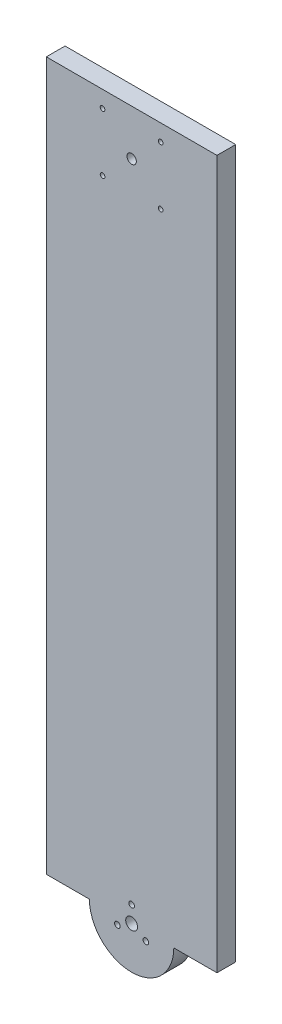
from build123d import *

# Parameters (mm, degrees)
SKETCH1_R           = 1.25
SKETCH1_R_2         = 2.5
SKETCH1_R_3         = 1.5
SKETCH1_R_4         = 3.15
BOSS_EXTRUDE1_DEPTH = 10
SKETCH2_W           = 10
SKETCH2_H           = 377.5
BOSS_EXTRUDE2_DEPTH = 23
SKETCH3_W           = 10
SKETCH3_H           = 377.5
BOSS_EXTRUDE3_DEPTH = 23


with BuildPart() as part:
    # Sketch1 → Boss-Extrude1 (new body)
    with BuildSketch(Plane.XY):
        with BuildLine():
            Line((-22.5, 130), (22.5, 130))
            Line((22.5, 130), (22.5, -247.5))
            ThreePointArc((22.5, -247.5), (0, -270), (-22.5, -247.5))
            Line((-22.5, -247.5), (-22.5, 130))
        make_face()
        with Locations((-15.5, 121.163920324)):
            Circle(SKETCH1_R, mode=Mode.SUBTRACT)
        with Locations(Location((15.5, 121.163920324, 0), (0, 0, 180))):
            Circle(SKETCH1_R, mode=Mode.SUBTRACT)
        with Locations((15.5, 90.163920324)):
            Circle(SKETCH1_R, mode=Mode.SUBTRACT)
        with Locations(Location((-15.5, 90.163920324, 0), (0, 0, 180))):
            Circle(SKETCH1_R, mode=Mode.SUBTRACT)
        with Locations((0, 105.663920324)):
            Circle(SKETCH1_R_2, mode=Mode.SUBTRACT)
        with Locations((0, -238.75)):
            Circle(SKETCH1_R_3, mode=Mode.SUBTRACT)
        with Locations((0, -247.5)):
            Circle(SKETCH1_R_4, mode=Mode.SUBTRACT)
        with Locations((7.577722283, -251.875)):
            Circle(SKETCH1_R_3, mode=Mode.SUBTRACT)
        with Locations((-7.577722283, -251.875)):
            Circle(SKETCH1_R_3, mode=Mode.SUBTRACT)
    extrude(amount=BOSS_EXTRUDE1_DEPTH)

    # Sketch2 → Boss-Extrude2 (add)
    with BuildSketch(Plane(origin=(22.5, 0, 0), x_dir=(0, 0, -1), z_dir=(1, 0, 0))):
        with Locations((-5, -58.75)):
            Rectangle(SKETCH2_W, SKETCH2_H)
    extrude(amount=BOSS_EXTRUDE2_DEPTH)

    # Sketch3 → Boss-Extrude3 (add)
    with BuildSketch(Plane.ZY.offset(22.5)):
        with Locations((5, -58.75)):
            Rectangle(SKETCH3_W, SKETCH3_H)
    extrude(amount=BOSS_EXTRUDE3_DEPTH)


solid = part.part
